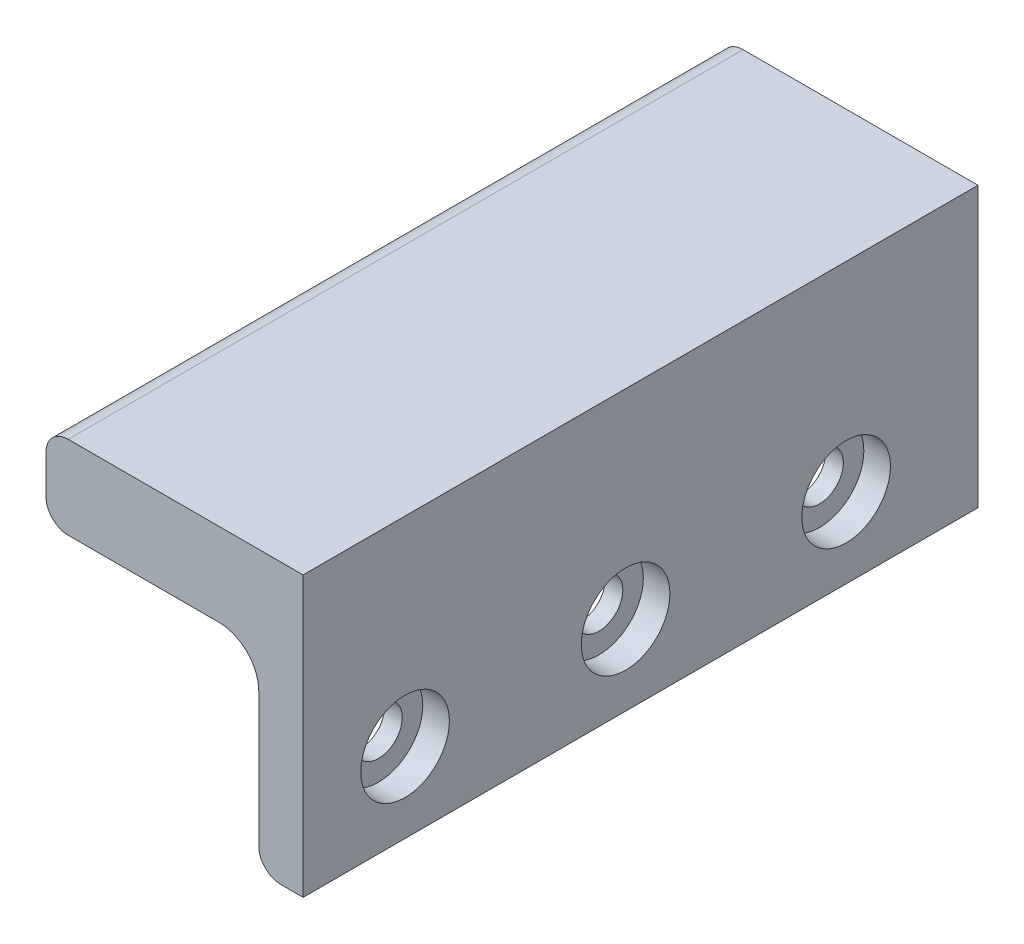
from build123d import *

# Parameters (mm, degrees)
EXTRUDE1_DEPTH                 = 60.9
CBORE_FOR_M4_SHCS1_D           = 4.3
CBORE_FOR_M4_SHCS1_CBORE_D     = 8
CBORE_FOR_M4_SHCS1_CBORE_DEPTH = 2.4
FILLET1_R                      = 2
FILLET4_R                      = 3.6
M5_0_5_DIAMETER_HOLE1_D        = 5
M5_0_5_DIAMETER_HOLE1_DEPTH    = 5
M5_0_5_DIAMETER_HOLE1_TIP      = 1.502151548


with BuildPart() as part:
    # Sketch1 → Extrude1 (new body)
    with BuildSketch(Plane.XY):
        Polygon((0, -7.5), (19.2, -7.5), (19.2, -25.2), (23.2, -25.2), (23.2, 0), (0, 0), align=None)
    extrude(amount=-EXTRUDE1_DEPTH)

    # CBORE for M4 SHCS1 (through all)
    with Locations(Plane(origin=(23.2, 0, 0), x_dir=(0, 0, -1), z_dir=(1, 0, 0))):
        with Locations((9.2, -18), (29.1, -18), (49, -18)):
            CounterBoreHole(CBORE_FOR_M4_SHCS1_D / 2, CBORE_FOR_M4_SHCS1_CBORE_D / 2, CBORE_FOR_M4_SHCS1_CBORE_DEPTH)

    # Fillet1
    fillet1_edges = [part.edges().sort_by_distance(p)[0] for p in [
        (19.2, -25.2, -30.45),
        (0, -7.5, -30.45),
        (0, 0, -30.45),
    ]]
    fillet(fillet1_edges, radius=FILLET1_R)

    # Fillet4
    fillet4_edges = [part.edges().sort_by_distance(p)[0] for p in [
        (19.2, -7.5, -30.45),
    ]]
    fillet(fillet4_edges, radius=FILLET4_R)

    # M5.0 _5_ Diameter Hole1
    with Locations(Plane.XZ.offset(7.5)):
        with Locations((10, -45.9), (10, -19.9)):
            Hole(M5_0_5_DIAMETER_HOLE1_D / 2, depth=M5_0_5_DIAMETER_HOLE1_DEPTH)
            with Locations((0, 0, -(M5_0_5_DIAMETER_HOLE1_DEPTH + M5_0_5_DIAMETER_HOLE1_TIP / 2))):  # 118° drill point
                Cone(0, M5_0_5_DIAMETER_HOLE1_D / 2, M5_0_5_DIAMETER_HOLE1_TIP, mode=Mode.SUBTRACT)


solid = part.part
